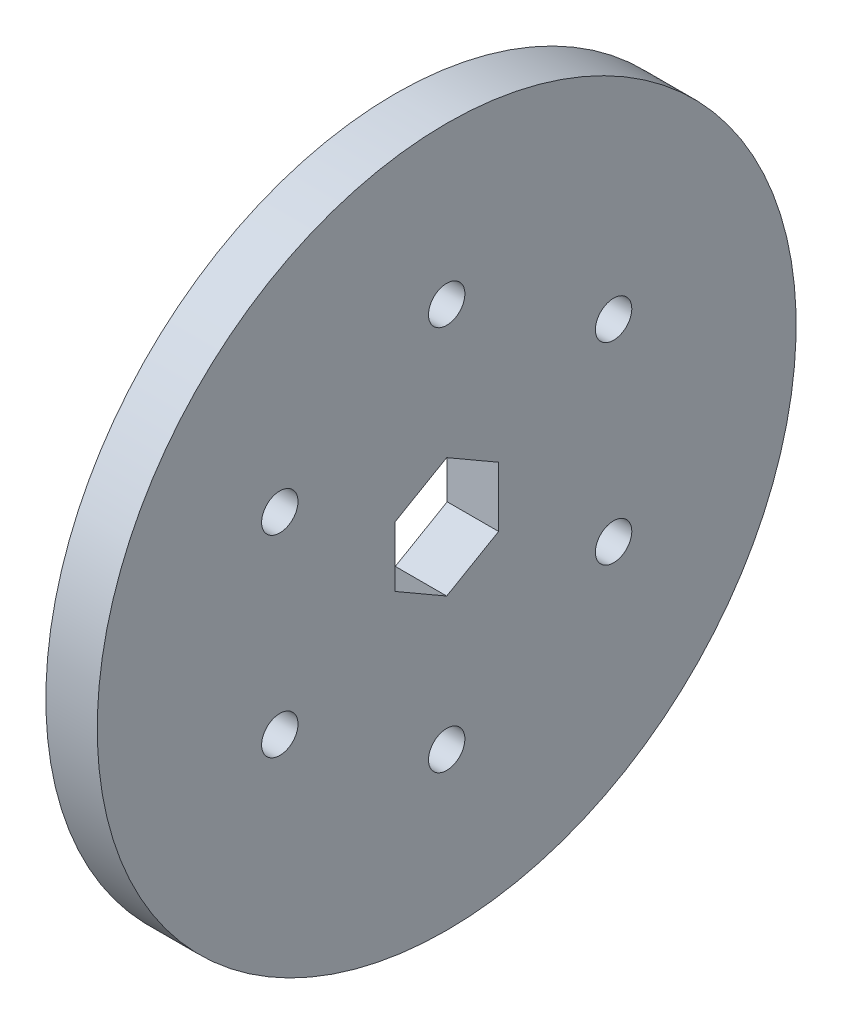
ISO-10303-21;
HEADER;
FILE_DESCRIPTION(('STEP AP214'),'2;1');
FILE_NAME('part.step','',(''),(''),'','','');
FILE_SCHEMA(('AUTOMOTIVE_DESIGN { 1 0 10303 214 1 1 1 1 }'));
ENDSEC;
DATA;
#1=APPLICATION_CONTEXT('core data for automotive mechanical design processes');
#2=APPLICATION_PROTOCOL_DEFINITION('international standard','automotive_design',2000,#1);
#3=PRODUCT_CONTEXT('',#1,'mechanical');
#4=PRODUCT('Part','Part','',(#3));
#5=PRODUCT_RELATED_PRODUCT_CATEGORY('part','',(#4));
#6=PRODUCT_DEFINITION_FORMATION('','',#4);
#7=PRODUCT_DEFINITION_CONTEXT('part definition',#1,'design');
#8=PRODUCT_DEFINITION('design','',#6,#7);
#9=PRODUCT_DEFINITION_SHAPE('','',#8);
#10=(LENGTH_UNIT() NAMED_UNIT(*) SI_UNIT(.MILLI.,.METRE.));
#11=(NAMED_UNIT(*) PLANE_ANGLE_UNIT() SI_UNIT($,.RADIAN.));
#12=(NAMED_UNIT(*) SI_UNIT($,.STERADIAN.) SOLID_ANGLE_UNIT());
#13=UNCERTAINTY_MEASURE_WITH_UNIT(LENGTH_MEASURE(1.E-05),#10,'distance_accuracy_value','');
#14=(GEOMETRIC_REPRESENTATION_CONTEXT(3) GLOBAL_UNCERTAINTY_ASSIGNED_CONTEXT((#13)) GLOBAL_UNIT_ASSIGNED_CONTEXT((#10,
#11,#12)) REPRESENTATION_CONTEXT('',''));
#15=CARTESIAN_POINT('',(0.,0.,0.));
#16=DIRECTION('',(0.,0.,1.));
#17=DIRECTION('',(1.,0.,0.));
#18=AXIS2_PLACEMENT_3D('',#15,#16,#17);
#19=CARTESIAN_POINT('',(-226.06,-200.983961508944,302.645365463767));
#20=DIRECTION('',(1.,0.,0.));
#21=DIRECTION('',(0.,-1.,0.));
#22=AXIS2_PLACEMENT_3D('',#19,#20,#21);
#23=PLANE('',#22);
#24=CARTESIAN_POINT('',(-226.06,-134.308961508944,428.125730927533));
#25=DIRECTION('',(1.,0.,0.));
#26=DIRECTION('',(0.,1.,0.));
#27=AXIS2_PLACEMENT_3D('',#24,#25,#26);
#28=CIRCLE('',#27,43.18);
#29=CARTESIAN_POINT('',(-226.06,-91.128961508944,428.125730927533));
#30=VERTEX_POINT('',#29);
#31=EDGE_CURVE('E11',#30,#30,#28,.T.);
#32=ORIENTED_EDGE('',*,*,#31,.F.);
#33=EDGE_LOOP('',(#32));
#34=FACE_BOUND('',#33,.T.);
#35=CARTESIAN_POINT('',(-226.06,-122.402711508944,448.74796085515));
#36=DIRECTION('',(1.,0.,0.));
#37=DIRECTION('',(0.,1.,0.));
#38=AXIS2_PLACEMENT_3D('',#35,#36,#37);
#39=CIRCLE('',#38,2.2479);
#40=CARTESIAN_POINT('',(-226.06,-120.154811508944,448.74796085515));
#41=VERTEX_POINT('',#40);
#42=EDGE_CURVE('E182',#41,#41,#39,.T.);
#43=ORIENTED_EDGE('',*,*,#42,.T.);
#44=EDGE_LOOP('',(#43));
#45=FACE_BOUND('',#44,.T.);
#46=CARTESIAN_POINT('',(-226.06,-110.496461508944,428.125730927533));
#47=DIRECTION('',(1.,0.,0.));
#48=DIRECTION('',(0.,1.,0.));
#49=AXIS2_PLACEMENT_3D('',#46,#47,#48);
#50=CIRCLE('',#49,2.2479);
#51=CARTESIAN_POINT('',(-226.06,-108.248561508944,428.125730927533));
#52=VERTEX_POINT('',#51);
#53=EDGE_CURVE('E188',#52,#52,#50,.T.);
#54=ORIENTED_EDGE('',*,*,#53,.T.);
#55=EDGE_LOOP('',(#54));
#56=FACE_BOUND('',#55,.T.);
#57=CARTESIAN_POINT('',(-226.06,-122.402711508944,407.503500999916));
#58=DIRECTION('',(1.,0.,0.));
#59=DIRECTION('',(0.,1.,0.));
#60=AXIS2_PLACEMENT_3D('',#57,#58,#59);
#61=CIRCLE('',#60,2.2479);
#62=CARTESIAN_POINT('',(-226.06,-120.154811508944,407.503500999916));
#63=VERTEX_POINT('',#62);
#64=EDGE_CURVE('E192',#63,#63,#61,.T.);
#65=ORIENTED_EDGE('',*,*,#64,.T.);
#66=EDGE_LOOP('',(#65));
#67=FACE_BOUND('',#66,.T.);
#68=CARTESIAN_POINT('',(-226.06,-146.215211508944,407.503500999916));
#69=DIRECTION('',(1.,0.,0.));
#70=DIRECTION('',(0.,1.,0.));
#71=AXIS2_PLACEMENT_3D('',#68,#69,#70);
#72=CIRCLE('',#71,2.2479);
#73=CARTESIAN_POINT('',(-226.06,-143.967311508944,407.503500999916));
#74=VERTEX_POINT('',#73);
#75=EDGE_CURVE('E175',#74,#74,#72,.T.);
#76=ORIENTED_EDGE('',*,*,#75,.T.);
#77=EDGE_LOOP('',(#76));
#78=FACE_BOUND('',#77,.T.);
#79=CARTESIAN_POINT('',(-226.06,-158.121461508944,428.125730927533));
#80=DIRECTION('',(1.,0.,0.));
#81=DIRECTION('',(0.,1.,0.));
#82=AXIS2_PLACEMENT_3D('',#79,#80,#81);
#83=CIRCLE('',#82,2.2479);
#84=CARTESIAN_POINT('',(-226.06,-155.873561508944,428.125730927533));
#85=VERTEX_POINT('',#84);
#86=EDGE_CURVE('E201',#85,#85,#83,.T.);
#87=ORIENTED_EDGE('',*,*,#86,.T.);
#88=EDGE_LOOP('',(#87));
#89=FACE_BOUND('',#88,.T.);
#90=CARTESIAN_POINT('',(-226.06,-146.215211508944,448.74796085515));
#91=DIRECTION('',(1.,0.,0.));
#92=DIRECTION('',(0.,1.,0.));
#93=AXIS2_PLACEMENT_3D('',#90,#91,#92);
#94=CIRCLE('',#93,2.2479);
#95=CARTESIAN_POINT('',(-226.06,-143.967311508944,448.74796085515));
#96=VERTEX_POINT('',#95);
#97=EDGE_CURVE('E207',#96,#96,#94,.T.);
#98=ORIENTED_EDGE('',*,*,#97,.T.);
#99=EDGE_LOOP('',(#98));
#100=FACE_BOUND('',#99,.T.);
#101=DIRECTION('',(0.,-1.,0.));
#102=VECTOR('',#101,1.);
#103=CARTESIAN_POINT('',(-226.06,-134.308961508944,434.539230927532));
#104=LINE('',#103,#102);
#105=CARTESIAN_POINT('',(-226.06,-130.606125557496,434.539230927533));
#106=VERTEX_POINT('',#105);
#107=CARTESIAN_POINT('',(-226.06,-138.011797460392,434.539230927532));
#108=VERTEX_POINT('',#107);
#109=EDGE_CURVE('E394',#106,#108,#104,.T.);
#110=ORIENTED_EDGE('',*,*,#109,.T.);
#111=DIRECTION('',(0.,-0.5,-0.866025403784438));
#112=VECTOR('',#111,1.);
#113=CARTESIAN_POINT('',(-226.06,-139.863215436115,431.332480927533));
#114=LINE('',#113,#112);
#115=CARTESIAN_POINT('',(-226.06,-141.714633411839,428.125730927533));
#116=VERTEX_POINT('',#115);
#117=EDGE_CURVE('E145',#108,#116,#114,.T.);
#118=ORIENTED_EDGE('',*,*,#117,.T.);
#119=DIRECTION('',(0.,0.5,-0.866025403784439));
#120=VECTOR('',#119,1.);
#121=CARTESIAN_POINT('',(-226.06,-139.863215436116,424.918980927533));
#122=LINE('',#121,#120);
#123=CARTESIAN_POINT('',(-226.06,-138.011797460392,421.712230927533));
#124=VERTEX_POINT('',#123);
#125=EDGE_CURVE('E139',#116,#124,#122,.T.);
#126=ORIENTED_EDGE('',*,*,#125,.T.);
#127=DIRECTION('',(0.,1.,0.));
#128=VECTOR('',#127,1.);
#129=CARTESIAN_POINT('',(-226.06,-134.308961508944,421.712230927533));
#130=LINE('',#129,#128);
#131=CARTESIAN_POINT('',(-226.06,-130.606125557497,421.712230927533));
#132=VERTEX_POINT('',#131);
#133=EDGE_CURVE('E143',#124,#132,#130,.T.);
#134=ORIENTED_EDGE('',*,*,#133,.T.);
#135=DIRECTION('',(0.,0.5,0.866025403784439));
#136=VECTOR('',#135,1.);
#137=CARTESIAN_POINT('',(-226.06,-128.754707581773,424.918980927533));
#138=LINE('',#137,#136);
#139=CARTESIAN_POINT('',(-226.06,-126.903289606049,428.125730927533));
#140=VERTEX_POINT('',#139);
#141=EDGE_CURVE('E410',#132,#140,#138,.T.);
#142=ORIENTED_EDGE('',*,*,#141,.T.);
#143=DIRECTION('',(0.,-0.5,0.866025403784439));
#144=VECTOR('',#143,1.);
#145=CARTESIAN_POINT('',(-226.06,-128.754707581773,431.332480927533));
#146=LINE('',#145,#144);
#147=EDGE_CURVE('E405',#140,#106,#146,.T.);
#148=ORIENTED_EDGE('',*,*,#147,.T.);
#149=EDGE_LOOP('',(#110,#118,#126,#134,#142,#148));
#150=FACE_BOUND('',#149,.T.);
#151=ADVANCED_FACE('F17',(#34,#45,#56,#67,#78,#89,#100,#150),#23,.F.);
#152=CARTESIAN_POINT('',(-219.71,-200.983961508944,302.645365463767));
#153=DIRECTION('',(1.,0.,0.));
#154=DIRECTION('',(0.,-1.,0.));
#155=AXIS2_PLACEMENT_3D('',#152,#153,#154);
#156=PLANE('',#155);
#157=CARTESIAN_POINT('',(-219.71,-134.308961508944,428.125730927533));
#158=DIRECTION('',(1.,0.,0.));
#159=DIRECTION('',(0.,1.,0.));
#160=AXIS2_PLACEMENT_3D('',#157,#158,#159);
#161=CIRCLE('',#160,43.18);
#162=CARTESIAN_POINT('',(-219.71,-91.1289615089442,428.125730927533));
#163=VERTEX_POINT('',#162);
#164=EDGE_CURVE('E26',#163,#163,#161,.T.);
#165=ORIENTED_EDGE('',*,*,#164,.T.);
#166=EDGE_LOOP('',(#165));
#167=FACE_BOUND('',#166,.T.);
#168=CARTESIAN_POINT('',(-219.71,-122.402711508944,448.74796085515));
#169=DIRECTION('',(1.,0.,0.));
#170=DIRECTION('',(0.,1.,0.));
#171=AXIS2_PLACEMENT_3D('',#168,#169,#170);
#172=CIRCLE('',#171,2.2479);
#173=CARTESIAN_POINT('',(-219.71,-120.154811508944,448.74796085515));
#174=VERTEX_POINT('',#173);
#175=EDGE_CURVE('E179',#174,#174,#172,.T.);
#176=ORIENTED_EDGE('',*,*,#175,.F.);
#177=EDGE_LOOP('',(#176));
#178=FACE_BOUND('',#177,.T.);
#179=CARTESIAN_POINT('',(-219.71,-110.496461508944,428.125730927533));
#180=DIRECTION('',(1.,0.,0.));
#181=DIRECTION('',(0.,1.,0.));
#182=AXIS2_PLACEMENT_3D('',#179,#180,#181);
#183=CIRCLE('',#182,2.2479);
#184=CARTESIAN_POINT('',(-219.71,-108.248561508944,428.125730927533));
#185=VERTEX_POINT('',#184);
#186=EDGE_CURVE('E185',#185,#185,#183,.T.);
#187=ORIENTED_EDGE('',*,*,#186,.F.);
#188=EDGE_LOOP('',(#187));
#189=FACE_BOUND('',#188,.T.);
#190=CARTESIAN_POINT('',(-219.71,-122.402711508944,407.503500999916));
#191=DIRECTION('',(1.,0.,0.));
#192=DIRECTION('',(0.,1.,0.));
#193=AXIS2_PLACEMENT_3D('',#190,#191,#192);
#194=CIRCLE('',#193,2.2479);
#195=CARTESIAN_POINT('',(-219.71,-120.154811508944,407.503500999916));
#196=VERTEX_POINT('',#195);
#197=EDGE_CURVE('E189',#196,#196,#194,.T.);
#198=ORIENTED_EDGE('',*,*,#197,.F.);
#199=EDGE_LOOP('',(#198));
#200=FACE_BOUND('',#199,.T.);
#201=CARTESIAN_POINT('',(-219.71,-146.215211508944,407.503500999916));
#202=DIRECTION('',(1.,0.,0.));
#203=DIRECTION('',(0.,1.,0.));
#204=AXIS2_PLACEMENT_3D('',#201,#202,#203);
#205=CIRCLE('',#204,2.2479);
#206=CARTESIAN_POINT('',(-219.71,-143.967311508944,407.503500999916));
#207=VERTEX_POINT('',#206);
#208=EDGE_CURVE('E178',#207,#207,#205,.T.);
#209=ORIENTED_EDGE('',*,*,#208,.F.);
#210=EDGE_LOOP('',(#209));
#211=FACE_BOUND('',#210,.T.);
#212=CARTESIAN_POINT('',(-219.71,-158.121461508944,428.125730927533));
#213=DIRECTION('',(1.,0.,0.));
#214=DIRECTION('',(0.,1.,0.));
#215=AXIS2_PLACEMENT_3D('',#212,#213,#214);
#216=CIRCLE('',#215,2.2479);
#217=CARTESIAN_POINT('',(-219.71,-155.873561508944,428.125730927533));
#218=VERTEX_POINT('',#217);
#219=EDGE_CURVE('E177',#218,#218,#216,.T.);
#220=ORIENTED_EDGE('',*,*,#219,.F.);
#221=EDGE_LOOP('',(#220));
#222=FACE_BOUND('',#221,.T.);
#223=CARTESIAN_POINT('',(-219.71,-146.215211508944,448.74796085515));
#224=DIRECTION('',(1.,0.,0.));
#225=DIRECTION('',(0.,1.,0.));
#226=AXIS2_PLACEMENT_3D('',#223,#224,#225);
#227=CIRCLE('',#226,2.2479);
#228=CARTESIAN_POINT('',(-219.71,-143.967311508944,448.74796085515));
#229=VERTEX_POINT('',#228);
#230=EDGE_CURVE('E204',#229,#229,#227,.T.);
#231=ORIENTED_EDGE('',*,*,#230,.F.);
#232=EDGE_LOOP('',(#231));
#233=FACE_BOUND('',#232,.T.);
#234=DIRECTION('',(0.,-1.,0.));
#235=VECTOR('',#234,1.);
#236=CARTESIAN_POINT('',(-219.71,-134.308961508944,434.539230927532));
#237=LINE('',#236,#235);
#238=CARTESIAN_POINT('',(-219.71,-130.606125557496,434.539230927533));
#239=VERTEX_POINT('',#238);
#240=CARTESIAN_POINT('',(-219.71,-138.011797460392,434.539230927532));
#241=VERTEX_POINT('',#240);
#242=EDGE_CURVE('E381',#239,#241,#237,.T.);
#243=ORIENTED_EDGE('',*,*,#242,.F.);
#244=DIRECTION('',(0.,-0.5,0.866025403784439));
#245=VECTOR('',#244,1.);
#246=CARTESIAN_POINT('',(-219.71,-128.754707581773,431.332480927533));
#247=LINE('',#246,#245);
#248=CARTESIAN_POINT('',(-219.71,-126.903289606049,428.125730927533));
#249=VERTEX_POINT('',#248);
#250=EDGE_CURVE('E384',#249,#239,#247,.T.);
#251=ORIENTED_EDGE('',*,*,#250,.F.);
#252=DIRECTION('',(0.,0.5,0.866025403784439));
#253=VECTOR('',#252,1.);
#254=CARTESIAN_POINT('',(-219.71,-128.754707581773,424.918980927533));
#255=LINE('',#254,#253);
#256=CARTESIAN_POINT('',(-219.71,-130.606125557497,421.712230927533));
#257=VERTEX_POINT('',#256);
#258=EDGE_CURVE('E167',#257,#249,#255,.T.);
#259=ORIENTED_EDGE('',*,*,#258,.F.);
#260=DIRECTION('',(0.,1.,0.));
#261=VECTOR('',#260,1.);
#262=CARTESIAN_POINT('',(-219.71,-134.308961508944,421.712230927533));
#263=LINE('',#262,#261);
#264=CARTESIAN_POINT('',(-219.71,-138.011797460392,421.712230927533));
#265=VERTEX_POINT('',#264);
#266=EDGE_CURVE('E151',#265,#257,#263,.T.);
#267=ORIENTED_EDGE('',*,*,#266,.F.);
#268=DIRECTION('',(0.,0.5,-0.866025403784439));
#269=VECTOR('',#268,1.);
#270=CARTESIAN_POINT('',(-219.71,-139.863215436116,424.918980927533));
#271=LINE('',#270,#269);
#272=CARTESIAN_POINT('',(-219.71,-141.714633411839,428.125730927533));
#273=VERTEX_POINT('',#272);
#274=EDGE_CURVE('E157',#273,#265,#271,.T.);
#275=ORIENTED_EDGE('',*,*,#274,.F.);
#276=DIRECTION('',(0.,-0.5,-0.866025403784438));
#277=VECTOR('',#276,1.);
#278=CARTESIAN_POINT('',(-219.71,-139.863215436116,431.332480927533));
#279=LINE('',#278,#277);
#280=EDGE_CURVE('E210',#241,#273,#279,.T.);
#281=ORIENTED_EDGE('',*,*,#280,.F.);
#282=EDGE_LOOP('',(#243,#251,#259,#267,#275,#281));
#283=FACE_BOUND('',#282,.T.);
#284=ADVANCED_FACE('F19',(#167,#178,#189,#200,#211,#222,#233,#283),#156,.T.);
#285=CARTESIAN_POINT('',(-219.71,-134.308961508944,428.125730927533));
#286=DIRECTION('',(-1.,0.,0.));
#287=DIRECTION('',(0.,-1.,0.));
#288=AXIS2_PLACEMENT_3D('',#285,#286,#287);
#289=CYLINDRICAL_SURFACE('',#288,43.18);
#290=ORIENTED_EDGE('',*,*,#31,.T.);
#291=EDGE_LOOP('',(#290));
#292=FACE_BOUND('',#291,.T.);
#293=ORIENTED_EDGE('',*,*,#164,.F.);
#294=EDGE_LOOP('',(#293));
#295=FACE_BOUND('',#294,.T.);
#296=ADVANCED_FACE('F311',(#292,#295),#289,.T.);
#297=CARTESIAN_POINT('',(-219.71,-139.863215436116,431.332480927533));
#298=DIRECTION('',(0.,0.866025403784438,-0.5));
#299=DIRECTION('',(-1.,0.,0.));
#300=AXIS2_PLACEMENT_3D('',#297,#298,#299);
#301=PLANE('',#300);
#302=ORIENTED_EDGE('',*,*,#117,.F.);
#303=DIRECTION('',(-1.,0.,0.));
#304=VECTOR('',#303,1.);
#305=CARTESIAN_POINT('',(-219.71,-138.011797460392,434.539230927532));
#306=LINE('',#305,#304);
#307=EDGE_CURVE('E389',#241,#108,#306,.T.);
#308=ORIENTED_EDGE('',*,*,#307,.F.);
#309=ORIENTED_EDGE('',*,*,#280,.T.);
#310=DIRECTION('',(-1.,0.,0.));
#311=VECTOR('',#310,1.);
#312=CARTESIAN_POINT('',(-219.71,-141.714633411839,428.125730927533));
#313=LINE('',#312,#311);
#314=EDGE_CURVE('E150',#273,#116,#313,.T.);
#315=ORIENTED_EDGE('',*,*,#314,.T.);
#316=EDGE_LOOP('',(#302,#308,#309,#315));
#317=FACE_BOUND('',#316,.T.);
#318=ADVANCED_FACE('F303',(#317),#301,.T.);
#319=CARTESIAN_POINT('',(-219.71,-146.215211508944,448.74796085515));
#320=DIRECTION('',(-1.,0.,0.));
#321=DIRECTION('',(0.,-1.,0.));
#322=AXIS2_PLACEMENT_3D('',#319,#320,#321);
#323=CYLINDRICAL_SURFACE('',#322,2.2479);
#324=ORIENTED_EDGE('',*,*,#97,.F.);
#325=EDGE_LOOP('',(#324));
#326=FACE_BOUND('',#325,.T.);
#327=ORIENTED_EDGE('',*,*,#230,.T.);
#328=EDGE_LOOP('',(#327));
#329=FACE_BOUND('',#328,.T.);
#330=ADVANCED_FACE('F295',(#326,#329),#323,.F.);
#331=CARTESIAN_POINT('',(-219.71,-158.121461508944,428.125730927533));
#332=DIRECTION('',(-1.,0.,0.));
#333=DIRECTION('',(0.,-1.,0.));
#334=AXIS2_PLACEMENT_3D('',#331,#332,#333);
#335=CYLINDRICAL_SURFACE('',#334,2.2479);
#336=ORIENTED_EDGE('',*,*,#86,.F.);
#337=EDGE_LOOP('',(#336));
#338=FACE_BOUND('',#337,.T.);
#339=ORIENTED_EDGE('',*,*,#219,.T.);
#340=EDGE_LOOP('',(#339));
#341=FACE_BOUND('',#340,.T.);
#342=ADVANCED_FACE('F227',(#338,#341),#335,.F.);
#343=CARTESIAN_POINT('',(-219.71,-146.215211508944,407.503500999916));
#344=DIRECTION('',(-1.,0.,0.));
#345=DIRECTION('',(0.,-1.,0.));
#346=AXIS2_PLACEMENT_3D('',#343,#344,#345);
#347=CYLINDRICAL_SURFACE('',#346,2.2479);
#348=ORIENTED_EDGE('',*,*,#75,.F.);
#349=EDGE_LOOP('',(#348));
#350=FACE_BOUND('',#349,.T.);
#351=ORIENTED_EDGE('',*,*,#208,.T.);
#352=EDGE_LOOP('',(#351));
#353=FACE_BOUND('',#352,.T.);
#354=ADVANCED_FACE('F221',(#350,#353),#347,.F.);
#355=CARTESIAN_POINT('',(-219.71,-122.402711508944,407.503500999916));
#356=DIRECTION('',(-1.,0.,0.));
#357=DIRECTION('',(0.,-1.,0.));
#358=AXIS2_PLACEMENT_3D('',#355,#356,#357);
#359=CYLINDRICAL_SURFACE('',#358,2.2479);
#360=ORIENTED_EDGE('',*,*,#64,.F.);
#361=EDGE_LOOP('',(#360));
#362=FACE_BOUND('',#361,.T.);
#363=ORIENTED_EDGE('',*,*,#197,.T.);
#364=EDGE_LOOP('',(#363));
#365=FACE_BOUND('',#364,.T.);
#366=ADVANCED_FACE('F226',(#362,#365),#359,.F.);
#367=CARTESIAN_POINT('',(-219.71,-110.496461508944,428.125730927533));
#368=DIRECTION('',(-1.,0.,0.));
#369=DIRECTION('',(0.,-1.,0.));
#370=AXIS2_PLACEMENT_3D('',#367,#368,#369);
#371=CYLINDRICAL_SURFACE('',#370,2.2479);
#372=ORIENTED_EDGE('',*,*,#53,.F.);
#373=EDGE_LOOP('',(#372));
#374=FACE_BOUND('',#373,.T.);
#375=ORIENTED_EDGE('',*,*,#186,.T.);
#376=EDGE_LOOP('',(#375));
#377=FACE_BOUND('',#376,.T.);
#378=ADVANCED_FACE('F257',(#374,#377),#371,.F.);
#379=CARTESIAN_POINT('',(-219.71,-122.402711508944,448.74796085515));
#380=DIRECTION('',(-1.,0.,0.));
#381=DIRECTION('',(0.,-1.,0.));
#382=AXIS2_PLACEMENT_3D('',#379,#380,#381);
#383=CYLINDRICAL_SURFACE('',#382,2.2479);
#384=ORIENTED_EDGE('',*,*,#42,.F.);
#385=EDGE_LOOP('',(#384));
#386=FACE_BOUND('',#385,.T.);
#387=ORIENTED_EDGE('',*,*,#175,.T.);
#388=EDGE_LOOP('',(#387));
#389=FACE_BOUND('',#388,.T.);
#390=ADVANCED_FACE('F261',(#386,#389),#383,.F.);
#391=CARTESIAN_POINT('',(-219.71,-139.863215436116,424.918980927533));
#392=DIRECTION('',(0.,0.866025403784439,0.5));
#393=DIRECTION('',(1.,0.,0.));
#394=AXIS2_PLACEMENT_3D('',#391,#392,#393);
#395=PLANE('',#394);
#396=ORIENTED_EDGE('',*,*,#125,.F.);
#397=ORIENTED_EDGE('',*,*,#314,.F.);
#398=ORIENTED_EDGE('',*,*,#274,.T.);
#399=DIRECTION('',(-1.,0.,0.));
#400=VECTOR('',#399,1.);
#401=CARTESIAN_POINT('',(-219.71,-138.011797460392,421.712230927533));
#402=LINE('',#401,#400);
#403=EDGE_CURVE('E154',#265,#124,#402,.T.);
#404=ORIENTED_EDGE('',*,*,#403,.T.);
#405=EDGE_LOOP('',(#396,#397,#398,#404));
#406=FACE_BOUND('',#405,.T.);
#407=ADVANCED_FACE('F155',(#406),#395,.T.);
#408=CARTESIAN_POINT('',(-219.71,-134.308961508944,421.712230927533));
#409=DIRECTION('',(0.,0.,1.));
#410=DIRECTION('',(1.,0.,0.));
#411=AXIS2_PLACEMENT_3D('',#408,#409,#410);
#412=PLANE('',#411);
#413=ORIENTED_EDGE('',*,*,#133,.F.);
#414=ORIENTED_EDGE('',*,*,#403,.F.);
#415=ORIENTED_EDGE('',*,*,#266,.T.);
#416=DIRECTION('',(-1.,0.,0.));
#417=VECTOR('',#416,1.);
#418=CARTESIAN_POINT('',(-219.71,-130.606125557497,421.712230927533));
#419=LINE('',#418,#417);
#420=EDGE_CURVE('E164',#257,#132,#419,.T.);
#421=ORIENTED_EDGE('',*,*,#420,.T.);
#422=EDGE_LOOP('',(#413,#414,#415,#421));
#423=FACE_BOUND('',#422,.T.);
#424=ADVANCED_FACE('F162',(#423),#412,.T.);
#425=CARTESIAN_POINT('',(-219.71,-128.754707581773,424.918980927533));
#426=DIRECTION('',(0.,-0.866025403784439,0.5));
#427=DIRECTION('',(-1.,0.,0.));
#428=AXIS2_PLACEMENT_3D('',#425,#426,#427);
#429=PLANE('',#428);
#430=ORIENTED_EDGE('',*,*,#141,.F.);
#431=ORIENTED_EDGE('',*,*,#420,.F.);
#432=ORIENTED_EDGE('',*,*,#258,.T.);
#433=DIRECTION('',(-1.,0.,0.));
#434=VECTOR('',#433,1.);
#435=CARTESIAN_POINT('',(-219.71,-126.903289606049,428.125730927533));
#436=LINE('',#435,#434);
#437=EDGE_CURVE('E411',#249,#140,#436,.T.);
#438=ORIENTED_EDGE('',*,*,#437,.T.);
#439=EDGE_LOOP('',(#430,#431,#432,#438));
#440=FACE_BOUND('',#439,.T.);
#441=ADVANCED_FACE('F245',(#440),#429,.T.);
#442=CARTESIAN_POINT('',(-219.71,-128.754707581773,431.332480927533));
#443=DIRECTION('',(0.,-0.866025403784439,-0.5));
#444=DIRECTION('',(0.,0.5,-0.866025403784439));
#445=AXIS2_PLACEMENT_3D('',#442,#443,#444);
#446=PLANE('',#445);
#447=ORIENTED_EDGE('',*,*,#147,.F.);
#448=ORIENTED_EDGE('',*,*,#437,.F.);
#449=ORIENTED_EDGE('',*,*,#250,.T.);
#450=DIRECTION('',(-1.,0.,0.));
#451=VECTOR('',#450,1.);
#452=CARTESIAN_POINT('',(-219.71,-130.606125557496,434.539230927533));
#453=LINE('',#452,#451);
#454=EDGE_CURVE('E390',#239,#106,#453,.T.);
#455=ORIENTED_EDGE('',*,*,#454,.T.);
#456=EDGE_LOOP('',(#447,#448,#449,#455));
#457=FACE_BOUND('',#456,.T.);
#458=ADVANCED_FACE('F237',(#457),#446,.T.);
#459=CARTESIAN_POINT('',(-219.71,-134.308961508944,434.539230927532));
#460=DIRECTION('',(0.,0.,-1.));
#461=DIRECTION('',(0.,-1.,0.));
#462=AXIS2_PLACEMENT_3D('',#459,#460,#461);
#463=PLANE('',#462);
#464=ORIENTED_EDGE('',*,*,#109,.F.);
#465=ORIENTED_EDGE('',*,*,#454,.F.);
#466=ORIENTED_EDGE('',*,*,#242,.T.);
#467=ORIENTED_EDGE('',*,*,#307,.T.);
#468=EDGE_LOOP('',(#464,#465,#466,#467));
#469=FACE_BOUND('',#468,.T.);
#470=ADVANCED_FACE('F233',(#469),#463,.T.);
#471=CLOSED_SHELL('',(#151,#284,#296,#318,#330,#342,#354,#366,#378,#390,#407,#424,#441,#458,#470));
#472=MANIFOLD_SOLID_BREP('B1',#471);
#473=ADVANCED_BREP_SHAPE_REPRESENTATION('',(#18,#472),#14);
#474=SHAPE_DEFINITION_REPRESENTATION(#9,#473);
ENDSEC;
END-ISO-10303-21;
